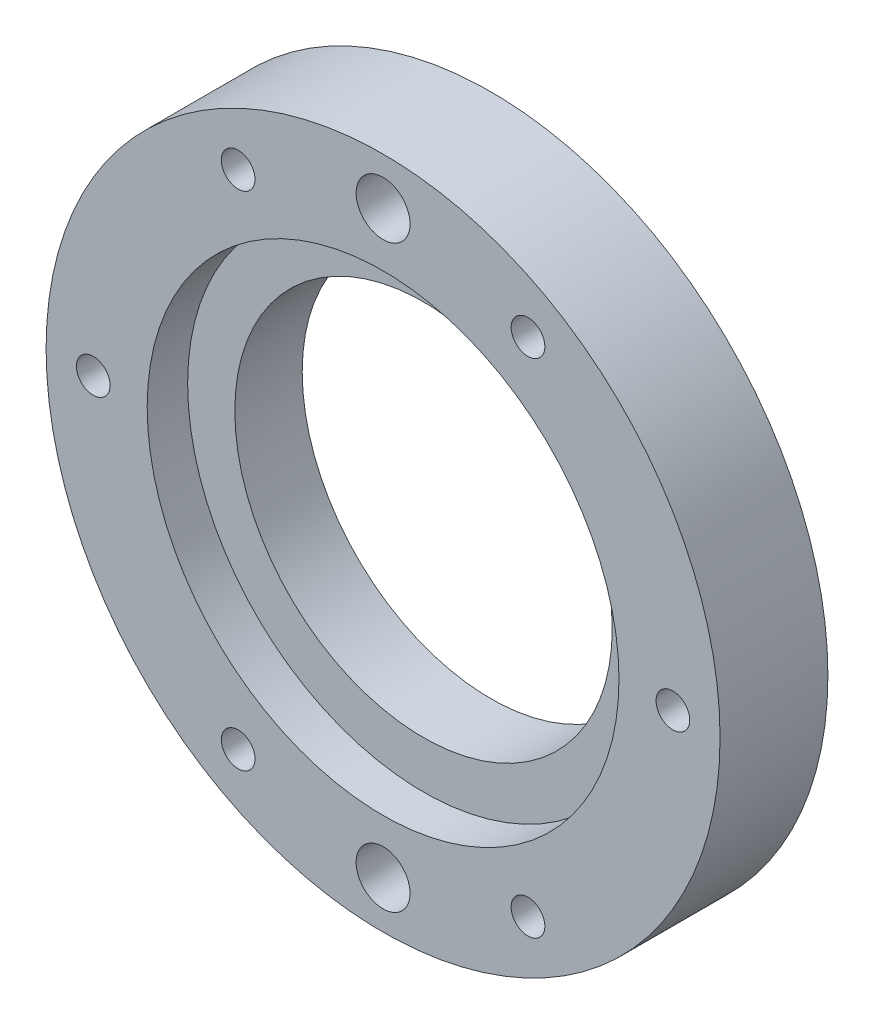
from build123d import *

# Parameters (mm, degrees)
SKETCH_2_R          = 25
SKETCH_2_R_2        = 17.5
EXTRUDE_1_DEPTH     = 8
SKETCH_3_R          = 2
CUT_EXTRUDE_1_DEPTH = 6
M3X0_5_1_D          = 2.5
M3X0_5_1_DEPTH      = 8.5
M3X0_5_1_TIP        = 0.751075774
SKETCH_6_R          = 17.5
SKETCH_6_R_2        = 14
EXTRUDE_2_DEPTH     = 5


with BuildPart() as part:
    # Sketch 2 → Extrude 1 (new body)
    with BuildSketch(Plane.XY):
        Circle(SKETCH_2_R)
        Circle(SKETCH_2_R_2, mode=Mode.SUBTRACT)
    extrude(amount=EXTRUDE_1_DEPTH)

    # Sketch 3 → Cut-Extrude 1 (cut)
    with BuildSketch(Plane.XY.offset(8)):
        with Locations((0, -21.5)):
            Circle(SKETCH_3_R)
        with Locations((0, 21.5)):
            Circle(SKETCH_3_R)
    extrude(amount=-CUT_EXTRUDE_1_DEPTH, mode=Mode.SUBTRACT)

    # M3x0.5 _1
    with Locations(Plane.XY.offset(8)):
        with Locations((-10.75, 18.619546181), (10.75, 18.619546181), (21.5, 0), (10.75, -18.619546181), (-10.75, -18.619546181), (-21.5, 0)):
            Hole(M3X0_5_1_D / 2, depth=M3X0_5_1_DEPTH)
            with Locations((0, 0, -(M3X0_5_1_DEPTH + M3X0_5_1_TIP / 2))):  # 118° drill point
                Cone(0, M3X0_5_1_D / 2, M3X0_5_1_TIP, mode=Mode.SUBTRACT)

    # Sketch 6 → Extrude 2 (add)
    with BuildSketch(Plane.XY):
        Circle(SKETCH_6_R)
        Circle(SKETCH_6_R_2, mode=Mode.SUBTRACT)
    extrude(amount=EXTRUDE_2_DEPTH)


solid = part.part
